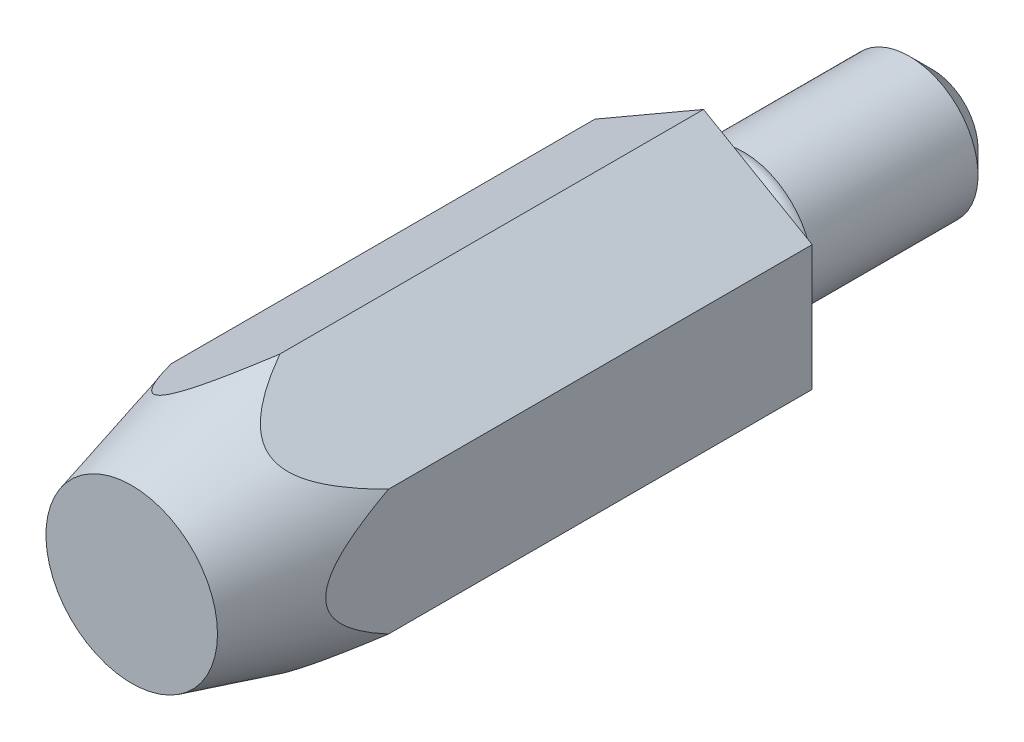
ISO-10303-21;
HEADER;
FILE_DESCRIPTION(('STEP AP214'),'2;1');
FILE_NAME('part.step','',(''),(''),'','','');
FILE_SCHEMA(('AUTOMOTIVE_DESIGN { 1 0 10303 214 1 1 1 1 }'));
ENDSEC;
DATA;
#1=APPLICATION_CONTEXT('core data for automotive mechanical design processes');
#2=APPLICATION_PROTOCOL_DEFINITION('international standard','automotive_design',2000,#1);
#3=PRODUCT_CONTEXT('',#1,'mechanical');
#4=PRODUCT('Part','Part','',(#3));
#5=PRODUCT_RELATED_PRODUCT_CATEGORY('part','',(#4));
#6=PRODUCT_DEFINITION_FORMATION('','',#4);
#7=PRODUCT_DEFINITION_CONTEXT('part definition',#1,'design');
#8=PRODUCT_DEFINITION('design','',#6,#7);
#9=PRODUCT_DEFINITION_SHAPE('','',#8);
#10=(LENGTH_UNIT() NAMED_UNIT(*) SI_UNIT(.MILLI.,.METRE.));
#11=(NAMED_UNIT(*) PLANE_ANGLE_UNIT() SI_UNIT($,.RADIAN.));
#12=(NAMED_UNIT(*) SI_UNIT($,.STERADIAN.) SOLID_ANGLE_UNIT());
#13=UNCERTAINTY_MEASURE_WITH_UNIT(LENGTH_MEASURE(1.E-05),#10,'distance_accuracy_value','');
#14=(GEOMETRIC_REPRESENTATION_CONTEXT(3) GLOBAL_UNCERTAINTY_ASSIGNED_CONTEXT((#13)) GLOBAL_UNIT_ASSIGNED_CONTEXT((#10,
#11,#12)) REPRESENTATION_CONTEXT('',''));
#15=CARTESIAN_POINT('',(0.,0.,0.));
#16=DIRECTION('',(0.,0.,1.));
#17=DIRECTION('',(1.,0.,0.));
#18=AXIS2_PLACEMENT_3D('',#15,#16,#17);
#19=CARTESIAN_POINT('',(-20.8974596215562,0.,0.));
#20=DIRECTION('',(0.,0.,-1.));
#21=DIRECTION('',(-1.,0.,0.));
#22=AXIS2_PLACEMENT_3D('',#19,#20,#21);
#23=PLANE('',#22);
#24=CARTESIAN_POINT('',(0.,0.,0.));
#25=DIRECTION('',(0.,0.,-1.));
#26=DIRECTION('',(-1.,0.,0.));
#27=AXIS2_PLACEMENT_3D('',#24,#25,#26);
#28=CIRCLE('',#27,6.);
#29=CARTESIAN_POINT('',(-6.,0.,0.));
#30=VERTEX_POINT('',#29);
#31=EDGE_CURVE('E9',#30,#30,#28,.F.);
#32=ORIENTED_EDGE('',*,*,#31,.T.);
#33=EDGE_LOOP('',(#32));
#34=FACE_BOUND('',#33,.T.);
#35=DIRECTION('',(0.,1.,0.));
#36=VECTOR('',#35,1.);
#37=CARTESIAN_POINT('',(9.5,-5.48482755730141,0.));
#38=LINE('',#37,#36);
#39=CARTESIAN_POINT('',(9.5,-5.48482755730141,0.));
#40=VERTEX_POINT('',#39);
#41=CARTESIAN_POINT('',(9.5,5.48482755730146,0.));
#42=VERTEX_POINT('',#41);
#43=EDGE_CURVE('E97',#40,#42,#38,.T.);
#44=ORIENTED_EDGE('',*,*,#43,.F.);
#45=DIRECTION('',(-0.866025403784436,-0.5,0.));
#46=VECTOR('',#45,1.);
#47=CARTESIAN_POINT('',(9.5,-5.48482755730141,0.));
#48=LINE('',#47,#46);
#49=CARTESIAN_POINT('',(0.,-10.9696551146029,0.));
#50=VERTEX_POINT('',#49);
#51=EDGE_CURVE('E90',#40,#50,#48,.T.);
#52=ORIENTED_EDGE('',*,*,#51,.T.);
#53=DIRECTION('',(0.866025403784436,-0.5,0.));
#54=VECTOR('',#53,1.);
#55=CARTESIAN_POINT('',(-9.5,-5.48482755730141,0.));
#56=LINE('',#55,#54);
#57=CARTESIAN_POINT('',(-9.5,-5.48482755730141,0.));
#58=VERTEX_POINT('',#57);
#59=EDGE_CURVE('E88',#58,#50,#56,.T.);
#60=ORIENTED_EDGE('',*,*,#59,.F.);
#61=DIRECTION('',(0.,1.,0.));
#62=VECTOR('',#61,1.);
#63=CARTESIAN_POINT('',(-9.5,-5.48482755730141,0.));
#64=LINE('',#63,#62);
#65=CARTESIAN_POINT('',(-9.5,5.48482755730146,0.));
#66=VERTEX_POINT('',#65);
#67=EDGE_CURVE('E37',#58,#66,#64,.T.);
#68=ORIENTED_EDGE('',*,*,#67,.T.);
#69=DIRECTION('',(0.86602540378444,0.5,0.));
#70=VECTOR('',#69,1.);
#71=CARTESIAN_POINT('',(-9.5,5.48482755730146,0.));
#72=LINE('',#71,#70);
#73=CARTESIAN_POINT('',(0.,10.9696551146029,0.));
#74=VERTEX_POINT('',#73);
#75=EDGE_CURVE('E77',#66,#74,#72,.T.);
#76=ORIENTED_EDGE('',*,*,#75,.T.);
#77=DIRECTION('',(-0.86602540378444,0.5,0.));
#78=VECTOR('',#77,1.);
#79=CARTESIAN_POINT('',(9.5,5.48482755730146,0.));
#80=LINE('',#79,#78);
#81=EDGE_CURVE('E83',#42,#74,#80,.T.);
#82=ORIENTED_EDGE('',*,*,#81,.F.);
#83=EDGE_LOOP('',(#44,#52,#60,#68,#76,#82));
#84=FACE_BOUND('',#83,.T.);
#85=ADVANCED_FACE('F14',(#34,#84),#23,.T.);
#86=CARTESIAN_POINT('',(9.5,-5.48482755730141,50.));
#87=DIRECTION('',(0.5,-0.866025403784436,0.));
#88=DIRECTION('',(0.866025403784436,0.5,0.));
#89=AXIS2_PLACEMENT_3D('',#86,#87,#88);
#90=PLANE('',#89);
#91=DIRECTION('',(0.,0.,-1.));
#92=VECTOR('',#91,1.);
#93=CARTESIAN_POINT('',(0.,-10.9696551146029,50.));
#94=LINE('',#93,#92);
#95=CARTESIAN_POINT('',(0.,-10.9696551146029,37.0510708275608));
#96=VERTEX_POINT('',#95);
#97=EDGE_CURVE('E29',#96,#50,#94,.T.);
#98=ORIENTED_EDGE('',*,*,#97,.T.);
#99=ORIENTED_EDGE('',*,*,#51,.F.);
#100=DIRECTION('',(0.,0.,-1.));
#101=VECTOR('',#100,1.);
#102=CARTESIAN_POINT('',(9.5,-5.48482755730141,50.));
#103=LINE('',#102,#101);
#104=CARTESIAN_POINT('',(9.5,-5.48482755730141,37.0510708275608));
#105=VERTEX_POINT('',#104);
#106=EDGE_CURVE('E102',#105,#40,#103,.T.);
#107=ORIENTED_EDGE('',*,*,#106,.F.);
#108=CARTESIAN_POINT('',(-0.000199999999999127,-10.9697705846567,37.0506398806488));
#109=CARTESIAN_POINT('',(0.063241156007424,-10.9331428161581,37.1873326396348));
#110=CARTESIAN_POINT('',(0.127415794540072,-10.8960915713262,37.3235703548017));
#111=CARTESIAN_POINT('',(0.257401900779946,-10.8210440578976,37.5950151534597));
#112=CARTESIAN_POINT('',(0.323213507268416,-10.7830477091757,37.7302221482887));
#113=CARTESIAN_POINT('',(0.52358223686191,-10.6673647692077,38.1345656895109));
#114=CARTESIAN_POINT('',(0.660846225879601,-10.5881153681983,38.4019320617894));
#115=CARTESIAN_POINT('',(0.945964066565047,-10.4235025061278,38.9334480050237));
#116=CARTESIAN_POINT('',(1.09392411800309,-10.3380777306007,39.1975219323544));
#117=CARTESIAN_POINT('',(1.40133261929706,-10.1605953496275,39.7164448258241));
#118=CARTESIAN_POINT('',(1.56077178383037,-10.0685431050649,39.9713010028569));
#119=CARTESIAN_POINT('',(1.80658859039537,-9.92662070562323,40.3365360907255));
#120=CARTESIAN_POINT('',(1.8871113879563,-9.8801308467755,40.4521723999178));
#121=CARTESIAN_POINT('',(2.05203968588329,-9.78490944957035,40.6797338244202));
#122=CARTESIAN_POINT('',(2.13644563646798,-9.73617765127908,40.7916585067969));
#123=CARTESIAN_POINT('',(2.30963852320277,-9.63618469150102,41.0107949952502));
#124=CARTESIAN_POINT('',(2.39842260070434,-9.58492518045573,41.1180097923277));
#125=CARTESIAN_POINT('',(2.58105231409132,-9.47948386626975,41.3264945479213));
#126=CARTESIAN_POINT('',(2.67489689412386,-9.42530267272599,41.4277657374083));
#127=CARTESIAN_POINT('',(2.92326823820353,-9.28190541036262,41.6780572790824));
#128=CARTESIAN_POINT('',(3.08203874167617,-9.19023921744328,41.8216040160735));
#129=CARTESIAN_POINT('',(3.41628357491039,-8.99726287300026,42.0799879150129));
#130=CARTESIAN_POINT('',(3.59170735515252,-8.89598190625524,42.1949083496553));
#131=CARTESIAN_POINT('',(3.89846693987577,-8.71887417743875,42.3503714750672));
#132=CARTESIAN_POINT('',(4.02515878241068,-8.64572860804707,42.402941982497));
#133=CARTESIAN_POINT('',(4.28429141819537,-8.49611831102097,42.4834886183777));
#134=CARTESIAN_POINT('',(4.41672433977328,-8.41965812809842,42.5114973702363));
#135=CARTESIAN_POINT('',(4.68463517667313,-8.26497973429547,42.5394927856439));
#136=CARTESIAN_POINT('',(4.82012611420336,-8.18675400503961,42.5393193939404));
#137=CARTESIAN_POINT('',(5.08881445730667,-8.03162671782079,42.5105818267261));
#138=CARTESIAN_POINT('',(5.2220104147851,-7.95472599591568,42.4820003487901));
#139=CARTESIAN_POINT('',(5.50988735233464,-7.78852016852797,42.3914485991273));
#140=CARTESIAN_POINT('',(5.66317687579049,-7.70001842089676,42.3237089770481));
#141=CARTESIAN_POINT('',(5.95849657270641,-7.52951551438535,42.1610504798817));
#142=CARTESIAN_POINT('',(6.10050010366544,-7.4475297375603,42.0660695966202));
#143=CARTESIAN_POINT('',(6.35806187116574,-7.29882638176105,41.8686641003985));
#144=CARTESIAN_POINT('',(6.4748037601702,-7.2314254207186,41.768247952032));
#145=CARTESIAN_POINT('',(6.70049227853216,-7.10112409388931,41.556241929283));
#146=CARTESIAN_POINT('',(6.80943179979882,-7.03822783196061,41.4446420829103));
#147=CARTESIAN_POINT('',(7.02120735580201,-6.91595915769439,41.2123939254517));
#148=CARTESIAN_POINT('',(7.12399508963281,-6.85661463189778,41.0916875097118));
#149=CARTESIAN_POINT('',(7.32359786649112,-6.74137391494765,40.8439982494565));
#150=CARTESIAN_POINT('',(7.4204152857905,-6.68547635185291,40.7170179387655));
#151=CARTESIAN_POINT('',(7.61460905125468,-6.57335852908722,40.4504481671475));
#152=CARTESIAN_POINT('',(7.71167453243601,-6.51731774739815,40.310558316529));
#153=CARTESIAN_POINT('',(7.90097311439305,-6.40802616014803,40.0264701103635));
#154=CARTESIAN_POINT('',(7.99320530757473,-6.35477587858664,39.8822709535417));
#155=CARTESIAN_POINT('',(8.26393146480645,-6.19847205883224,39.4442211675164));
#156=CARTESIAN_POINT('',(8.43621649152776,-6.09900325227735,39.1452552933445));
#157=CARTESIAN_POINT('',(8.76213529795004,-5.91083394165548,38.5496192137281));
#158=CARTESIAN_POINT('',(8.91622398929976,-5.82187079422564,38.2532756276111));
#159=CARTESIAN_POINT('',(9.1402790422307,-5.69251254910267,37.8047329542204));
#160=CARTESIAN_POINT('',(9.2136697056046,-5.65014042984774,37.654796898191));
#161=CARTESIAN_POINT('',(9.35840758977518,-5.56657597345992,37.3536392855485));
#162=CARTESIAN_POINT('',(9.42975506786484,-5.52538348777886,37.2024178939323));
#163=CARTESIAN_POINT('',(9.50020000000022,-5.48471208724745,37.0506398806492));
#164=B_SPLINE_CURVE_WITH_KNOTS('',3,(#108,#109,#110,#111,#112,#113,#114,#115,#116,#117,#118,
#119,#120,#121,#122,#123,#124,#125,#126,#127,#128,#129,#130,#131,#132,#133,#134,#135,#136,#137,
#138,#139,#140,#141,#142,#143,#144,#145,#146,#147,#148,#149,#150,#151,#152,#153,#154,#155,#156,
#157,#158,#159,#160,#161,#162,#163),.UNSPECIFIED.,.F.,.F.,(4,2,2,2,2,2,2,2,2,2,2,2,2,2,2,2,2,2,
2,2,2,2,2,2,2,2,2,4),(0.,0.46524752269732,0.930534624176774,1.8627826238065,2.80607583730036,
3.74861442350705,4.19366832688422,4.63877396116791,5.08359272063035,5.52831902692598,
6.2251376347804,6.9199049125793,7.38453577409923,7.84854856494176,8.31519672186,
8.78212927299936,9.34751434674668,9.91419673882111,10.4177403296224,10.9217369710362,
11.4292773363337,11.9366143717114,12.4742009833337,13.0118881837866,14.0885655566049,
15.1252825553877,15.6419477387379,16.1585475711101),.UNSPECIFIED.);
#165=EDGE_CURVE('E157',#96,#105,#164,.T.);
#166=ORIENTED_EDGE('',*,*,#165,.F.);
#167=EDGE_LOOP('',(#98,#99,#107,#166));
#168=FACE_BOUND('',#167,.T.);
#169=ADVANCED_FACE('F127',(#168),#90,.T.);
#170=CARTESIAN_POINT('',(9.5,-5.48482755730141,50.));
#171=DIRECTION('',(-1.,0.,0.));
#172=DIRECTION('',(0.,0.,1.));
#173=AXIS2_PLACEMENT_3D('',#170,#171,#172);
#174=PLANE('',#173);
#175=CARTESIAN_POINT('',(9.5,-5.50690282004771,37.0098157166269));
#176=CARTESIAN_POINT('',(9.5,-5.43449794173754,37.1453244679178));
#177=CARTESIAN_POINT('',(9.5,-5.36126926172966,37.2803919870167));
#178=CARTESIAN_POINT('',(9.5,-5.21297685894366,37.5495292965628));
#179=CARTESIAN_POINT('',(9.5,-5.13791299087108,37.6835990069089));
#180=CARTESIAN_POINT('',(9.5,-4.90945209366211,38.084549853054));
#181=CARTESIAN_POINT('',(9.5,-4.75302513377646,38.3497216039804));
#182=CARTESIAN_POINT('',(9.5,-4.42816442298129,38.8773190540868));
#183=CARTESIAN_POINT('',(9.5,-4.25960272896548,39.139666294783));
#184=CARTESIAN_POINT('',(9.5,-3.90967873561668,39.655539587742));
#185=CARTESIAN_POINT('',(9.5,-3.72832595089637,39.9090719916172));
#186=CARTESIAN_POINT('',(9.5,-3.44418451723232,40.2791865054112));
#187=CARTESIAN_POINT('',(9.5,-3.34768399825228,40.400597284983));
#188=CARTESIAN_POINT('',(9.5,-3.14987299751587,40.639483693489));
#189=CARTESIAN_POINT('',(9.5,-3.04856186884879,40.7569587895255));
#190=CARTESIAN_POINT('',(9.5,-2.84053345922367,40.9868074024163));
#191=CARTESIAN_POINT('',(9.5,-2.73382264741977,41.0991867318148));
#192=CARTESIAN_POINT('',(9.5,-2.51406548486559,41.3175306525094));
#193=CARTESIAN_POINT('',(9.5,-2.40102082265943,41.4234969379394));
#194=CARTESIAN_POINT('',(9.5,-2.11274503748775,41.6750665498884));
#195=CARTESIAN_POINT('',(9.5,-1.93325115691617,41.8159004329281));
#196=CARTESIAN_POINT('',(9.5,-1.55576465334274,42.0702530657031));
#197=CARTESIAN_POINT('',(9.5,-1.35782130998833,42.1838418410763));
#198=CARTESIAN_POINT('',(9.5,-1.00812100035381,42.3407212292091));
#199=CARTESIAN_POINT('',(9.5,-0.861322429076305,42.3948867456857));
#200=CARTESIAN_POINT('',(9.5,-0.560833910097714,42.4785511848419));
#201=CARTESIAN_POINT('',(9.5,-0.407153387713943,42.5080828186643));
#202=CARTESIAN_POINT('',(9.5,-0.0959284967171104,42.5388617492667));
#203=CARTESIAN_POINT('',(9.5,0.0616337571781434,42.539934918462));
#204=CARTESIAN_POINT('',(9.5,0.37425884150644,42.5132038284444));
#205=CARTESIAN_POINT('',(9.5,0.52932038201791,42.4853851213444));
#206=CARTESIAN_POINT('',(9.5,0.862120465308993,42.3966038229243));
#207=CARTESIAN_POINT('',(9.5,1.03838297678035,42.330234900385));
#208=CARTESIAN_POINT('',(9.5,1.37809462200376,42.1703677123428));
#209=CARTESIAN_POINT('',(9.5,1.54151464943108,42.076809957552));
#210=CARTESIAN_POINT('',(9.5,1.83708049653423,41.8826646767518));
#211=CARTESIAN_POINT('',(9.5,1.97064695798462,41.7841860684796));
#212=CARTESIAN_POINT('',(9.5,2.22894000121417,41.5761481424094));
#213=CARTESIAN_POINT('',(9.5,2.35365871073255,41.4665791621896));
#214=CARTESIAN_POINT('',(9.5,2.59636973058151,41.2382587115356));
#215=CARTESIAN_POINT('',(9.5,2.71429366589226,41.1194353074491));
#216=CARTESIAN_POINT('',(9.5,2.94328893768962,40.8755264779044));
#217=CARTESIAN_POINT('',(9.5,3.05436376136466,40.7504442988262));
#218=CARTESIAN_POINT('',(9.5,3.36003248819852,40.3901674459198));
#219=CARTESIAN_POINT('',(9.5,3.54790883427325,40.149283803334));
#220=CARTESIAN_POINT('',(9.5,3.90910308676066,39.6567624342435));
#221=CARTESIAN_POINT('',(9.5,4.08241002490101,39.4051168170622));
#222=CARTESIAN_POINT('',(9.5,4.4181487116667,38.8934314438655));
#223=CARTESIAN_POINT('',(9.5,4.58053946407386,38.6333649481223));
#224=CARTESIAN_POINT('',(9.5,4.89611131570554,38.1076958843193));
#225=CARTESIAN_POINT('',(9.5,5.04929122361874,37.8420926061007));
#226=CARTESIAN_POINT('',(9.5,5.33707356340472,37.3264992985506));
#227=CARTESIAN_POINT('',(9.5,5.47221212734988,37.0768071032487));
#228=CARTESIAN_POINT('',(9.5,5.73707028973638,36.5745409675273));
#229=CARTESIAN_POINT('',(9.5,5.86678934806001,36.321966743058));
#230=CARTESIAN_POINT('',(9.5,6.12050747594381,35.816690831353));
#231=CARTESIAN_POINT('',(9.5,6.24454619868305,35.5640089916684));
#232=CARTESIAN_POINT('',(9.5,6.48865135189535,35.0568027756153));
#233=CARTESIAN_POINT('',(9.5,6.60871868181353,34.8022788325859));
#234=CARTESIAN_POINT('',(9.5,6.72711372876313,34.5469917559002));
#235=B_SPLINE_CURVE_WITH_KNOTS('',3,(#175,#176,#177,#178,#179,#180,#181,#182,#183,#184,#185,
#186,#187,#188,#189,#190,#191,#192,#193,#194,#195,#196,#197,#198,#199,#200,#201,#202,#203,#204,
#205,#206,#207,#208,#209,#210,#211,#212,#213,#214,#215,#216,#217,#218,#219,#220,#221,#222,#223,
#224,#225,#226,#227,#228,#229,#230,#231,#232,#233,#234),.UNSPECIFIED.,.F.,.F.,(4,2,2,2,2,2,2,2,
2,2,2,2,2,2,2,2,2,2,2,2,2,2,2,2,2,2,2,2,2,4),(0.,0.460912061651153,0.921860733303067,
1.84528955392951,2.78052501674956,3.71507199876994,4.18024448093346,4.64547969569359,
5.11017015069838,5.57473730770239,6.25758051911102,6.93864940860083,7.40634742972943,
7.87342340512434,8.34335660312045,8.81352491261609,9.37539882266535,9.93851149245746,
10.4356286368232,10.9331826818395,11.4350886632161,11.9367369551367,12.8523481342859,
13.7686425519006,14.6882053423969,15.6078868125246,16.4595595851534,17.3113170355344,
18.1557358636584,18.9999621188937),.UNSPECIFIED.);
#236=CARTESIAN_POINT('',(9.5,5.48482755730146,37.0510708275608));
#237=VERTEX_POINT('',#236);
#238=EDGE_CURVE('E151',#237,#105,#235,.F.);
#239=ORIENTED_EDGE('',*,*,#238,.T.);
#240=ORIENTED_EDGE('',*,*,#106,.T.);
#241=ORIENTED_EDGE('',*,*,#43,.T.);
#242=DIRECTION('',(0.,0.,-1.));
#243=VECTOR('',#242,1.);
#244=CARTESIAN_POINT('',(9.5,5.48482755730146,50.));
#245=LINE('',#244,#243);
#246=EDGE_CURVE('E100',#237,#42,#245,.T.);
#247=ORIENTED_EDGE('',*,*,#246,.F.);
#248=EDGE_LOOP('',(#239,#240,#241,#247));
#249=FACE_BOUND('',#248,.T.);
#250=ADVANCED_FACE('F163',(#249),#174,.F.);
#251=CARTESIAN_POINT('',(9.5,5.48482755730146,50.));
#252=DIRECTION('',(-0.5,-0.86602540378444,0.));
#253=DIRECTION('',(0.86602540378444,-0.5,0.));
#254=AXIS2_PLACEMENT_3D('',#251,#252,#253);
#255=PLANE('',#254);
#256=CARTESIAN_POINT('',(-0.000200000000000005,10.9697705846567,37.050639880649));
#257=CARTESIAN_POINT('',(0.0632411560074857,10.9331428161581,37.1873326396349));
#258=CARTESIAN_POINT('',(0.127415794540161,10.8960915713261,37.3235703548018));
#259=CARTESIAN_POINT('',(0.257401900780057,10.8210440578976,37.5950151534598));
#260=CARTESIAN_POINT('',(0.323213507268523,10.7830477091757,37.7302221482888));
#261=CARTESIAN_POINT('',(0.523582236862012,10.6673647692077,38.134565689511));
#262=CARTESIAN_POINT('',(0.66084622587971,10.5881153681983,38.4019320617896));
#263=CARTESIAN_POINT('',(0.945964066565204,10.4235025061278,38.9334480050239));
#264=CARTESIAN_POINT('',(1.09392411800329,10.3380777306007,39.1975219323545));
#265=CARTESIAN_POINT('',(1.4013326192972,10.1605953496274,39.7164448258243));
#266=CARTESIAN_POINT('',(1.5607717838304,10.0685431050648,39.9713010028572));
#267=CARTESIAN_POINT('',(1.80658859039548,9.92662070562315,40.3365360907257));
#268=CARTESIAN_POINT('',(1.88711138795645,9.88013084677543,40.4521723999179));
#269=CARTESIAN_POINT('',(2.05203968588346,9.78490944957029,40.6797338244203));
#270=CARTESIAN_POINT('',(2.13644563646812,9.73617765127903,40.791658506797));
#271=CARTESIAN_POINT('',(2.30963852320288,9.63618469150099,41.0107949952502));
#272=CARTESIAN_POINT('',(2.39842260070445,9.58492518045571,41.1180097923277));
#273=CARTESIAN_POINT('',(2.58105231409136,9.47948386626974,41.3264945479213));
#274=CARTESIAN_POINT('',(2.67489689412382,9.425302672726,41.4277657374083));
#275=CARTESIAN_POINT('',(2.92326823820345,9.28190541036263,41.6780572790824));
#276=CARTESIAN_POINT('',(3.08203874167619,9.19023921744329,41.8216040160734));
#277=CARTESIAN_POINT('',(3.41628357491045,8.99726287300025,42.0799879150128));
#278=CARTESIAN_POINT('',(3.59170735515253,8.89598190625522,42.1949083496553));
#279=CARTESIAN_POINT('',(3.8984669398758,8.71887417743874,42.3503714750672));
#280=CARTESIAN_POINT('',(4.02515878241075,8.64572860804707,42.4029419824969));
#281=CARTESIAN_POINT('',(4.28429141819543,8.49611831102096,42.4834886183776));
#282=CARTESIAN_POINT('',(4.41672433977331,8.4196581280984,42.5114973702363));
#283=CARTESIAN_POINT('',(4.68463517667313,8.26497973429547,42.5394927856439));
#284=CARTESIAN_POINT('',(4.82012611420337,8.18675400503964,42.5393193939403));
#285=CARTESIAN_POINT('',(5.08881445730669,8.03162671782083,42.510581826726));
#286=CARTESIAN_POINT('',(5.22201041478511,7.95472599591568,42.4820003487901));
#287=CARTESIAN_POINT('',(5.50988735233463,7.78852016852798,42.3914485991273));
#288=CARTESIAN_POINT('',(5.66317687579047,7.70001842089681,42.323708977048));
#289=CARTESIAN_POINT('',(5.9584965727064,7.5295155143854,42.1610504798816));
#290=CARTESIAN_POINT('',(6.10050010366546,7.44752973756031,42.0660695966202));
#291=CARTESIAN_POINT('',(6.35806187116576,7.29882638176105,41.8686641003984));
#292=CARTESIAN_POINT('',(6.4748037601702,7.23142542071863,41.7682479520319));
#293=CARTESIAN_POINT('',(6.70049227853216,7.10112409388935,41.5562419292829));
#294=CARTESIAN_POINT('',(6.80943179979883,7.03822783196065,41.4446420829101));
#295=CARTESIAN_POINT('',(7.02120735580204,6.91595915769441,41.2123939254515));
#296=CARTESIAN_POINT('',(7.12399508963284,6.85661463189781,41.0916875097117));
#297=CARTESIAN_POINT('',(7.32359786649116,6.74137391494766,40.8439982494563));
#298=CARTESIAN_POINT('',(7.42041528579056,6.6854763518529,40.7170179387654));
#299=CARTESIAN_POINT('',(7.61460905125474,6.57335852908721,40.4504481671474));
#300=CARTESIAN_POINT('',(7.71167453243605,6.51731774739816,40.3105583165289));
#301=CARTESIAN_POINT('',(7.90097311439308,6.40802616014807,40.0264701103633));
#302=CARTESIAN_POINT('',(7.99320530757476,6.35477587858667,39.8822709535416));
#303=CARTESIAN_POINT('',(8.26393146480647,6.19847205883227,39.4442211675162));
#304=CARTESIAN_POINT('',(8.43621649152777,6.09900325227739,39.1452552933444));
#305=CARTESIAN_POINT('',(8.76213529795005,5.91083394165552,38.549619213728));
#306=CARTESIAN_POINT('',(8.91622398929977,5.82187079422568,38.253275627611));
#307=CARTESIAN_POINT('',(9.14027904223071,5.69251254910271,37.8047329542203));
#308=CARTESIAN_POINT('',(9.21366970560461,5.65014042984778,37.6547968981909));
#309=CARTESIAN_POINT('',(9.35840758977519,5.56657597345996,37.3536392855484));
#310=CARTESIAN_POINT('',(9.42975506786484,5.5253834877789,37.2024178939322));
#311=CARTESIAN_POINT('',(9.50020000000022,5.48471208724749,37.0506398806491));
#312=B_SPLINE_CURVE_WITH_KNOTS('',3,(#256,#257,#258,#259,#260,#261,#262,#263,#264,#265,#266,
#267,#268,#269,#270,#271,#272,#273,#274,#275,#276,#277,#278,#279,#280,#281,#282,#283,#284,#285,
#286,#287,#288,#289,#290,#291,#292,#293,#294,#295,#296,#297,#298,#299,#300,#301,#302,#303,#304,
#305,#306,#307,#308,#309,#310,#311),.UNSPECIFIED.,.F.,.F.,(4,2,2,2,2,2,2,2,2,2,2,2,2,2,2,2,2,2,
2,2,2,2,2,2,2,2,2,4),(0.,0.465247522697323,0.930534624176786,1.86278262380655,2.80607583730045,
3.74861442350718,4.19366832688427,4.63877396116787,5.08359272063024,5.52831902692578,
6.22513763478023,6.91990491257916,7.38453577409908,7.8485485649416,8.31519672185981,
8.78212927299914,9.34751434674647,9.91419673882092,10.4177403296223,10.921736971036,
11.4292773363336,11.9366143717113,12.4742009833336,13.0118881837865,14.0885655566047,
15.1252825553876,15.6419477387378,16.1585475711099),.UNSPECIFIED.);
#313=CARTESIAN_POINT('',(0.,10.9696551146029,37.0510708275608));
#314=VERTEX_POINT('',#313);
#315=EDGE_CURVE('E145',#314,#237,#312,.T.);
#316=ORIENTED_EDGE('',*,*,#315,.T.);
#317=ORIENTED_EDGE('',*,*,#246,.T.);
#318=ORIENTED_EDGE('',*,*,#81,.T.);
#319=DIRECTION('',(0.,0.,-1.));
#320=VECTOR('',#319,1.);
#321=CARTESIAN_POINT('',(0.,10.9696551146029,50.));
#322=LINE('',#321,#320);
#323=EDGE_CURVE('E73',#314,#74,#322,.T.);
#324=ORIENTED_EDGE('',*,*,#323,.F.);
#325=EDGE_LOOP('',(#316,#317,#318,#324));
#326=FACE_BOUND('',#325,.T.);
#327=ADVANCED_FACE('F136',(#326),#255,.F.);
#328=CARTESIAN_POINT('',(-9.5,5.48482755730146,50.));
#329=DIRECTION('',(-0.5,0.86602540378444,0.));
#330=DIRECTION('',(-0.86602540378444,-0.5,0.));
#331=AXIS2_PLACEMENT_3D('',#328,#329,#330);
#332=PLANE('',#331);
#333=ORIENTED_EDGE('',*,*,#323,.T.);
#334=ORIENTED_EDGE('',*,*,#75,.F.);
#335=DIRECTION('',(0.,0.,-1.));
#336=VECTOR('',#335,1.);
#337=CARTESIAN_POINT('',(-9.5,5.48482755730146,50.));
#338=LINE('',#337,#336);
#339=CARTESIAN_POINT('',(-9.5,5.48482755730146,37.0510708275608));
#340=VERTEX_POINT('',#339);
#341=EDGE_CURVE('E66',#340,#66,#338,.T.);
#342=ORIENTED_EDGE('',*,*,#341,.F.);
#343=CARTESIAN_POINT('',(0.000199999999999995,10.9697705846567,37.050639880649));
#344=CARTESIAN_POINT('',(-0.0632411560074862,10.9331428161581,37.1873326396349));
#345=CARTESIAN_POINT('',(-0.127415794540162,10.8960915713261,37.3235703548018));
#346=CARTESIAN_POINT('',(-0.257401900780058,10.8210440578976,37.5950151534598));
#347=CARTESIAN_POINT('',(-0.323213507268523,10.7830477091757,37.7302221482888));
#348=CARTESIAN_POINT('',(-0.523582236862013,10.6673647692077,38.134565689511));
#349=CARTESIAN_POINT('',(-0.660846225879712,10.5881153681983,38.4019320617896));
#350=CARTESIAN_POINT('',(-0.945964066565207,10.4235025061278,38.9334480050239));
#351=CARTESIAN_POINT('',(-1.09392411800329,10.3380777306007,39.1975219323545));
#352=CARTESIAN_POINT('',(-1.4013326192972,10.1605953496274,39.7164448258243));
#353=CARTESIAN_POINT('',(-1.5607717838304,10.0685431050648,39.9713010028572));
#354=CARTESIAN_POINT('',(-1.80658859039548,9.92662070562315,40.3365360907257));
#355=CARTESIAN_POINT('',(-1.88711138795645,9.88013084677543,40.4521723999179));
#356=CARTESIAN_POINT('',(-2.05203968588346,9.78490944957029,40.6797338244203));
#357=CARTESIAN_POINT('',(-2.13644563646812,9.73617765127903,40.791658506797));
#358=CARTESIAN_POINT('',(-2.30963852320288,9.63618469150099,41.0107949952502));
#359=CARTESIAN_POINT('',(-2.39842260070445,9.5849251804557,41.1180097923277));
#360=CARTESIAN_POINT('',(-2.58105231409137,9.47948386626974,41.3264945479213));
#361=CARTESIAN_POINT('',(-2.67489689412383,9.425302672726,41.4277657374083));
#362=CARTESIAN_POINT('',(-2.92326823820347,9.28190541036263,41.6780572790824));
#363=CARTESIAN_POINT('',(-3.0820387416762,9.19023921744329,41.8216040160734));
#364=CARTESIAN_POINT('',(-3.41628357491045,8.99726287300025,42.0799879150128));
#365=CARTESIAN_POINT('',(-3.59170735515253,8.89598190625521,42.1949083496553));
#366=CARTESIAN_POINT('',(-3.8984669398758,8.71887417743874,42.3503714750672));
#367=CARTESIAN_POINT('',(-4.02515878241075,8.64572860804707,42.4029419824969));
#368=CARTESIAN_POINT('',(-4.28429141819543,8.49611831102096,42.4834886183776));
#369=CARTESIAN_POINT('',(-4.41672433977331,8.41965812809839,42.5114973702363));
#370=CARTESIAN_POINT('',(-4.68463517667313,8.26497973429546,42.5394927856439));
#371=CARTESIAN_POINT('',(-4.82012611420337,8.18675400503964,42.5393193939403));
#372=CARTESIAN_POINT('',(-5.08881445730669,8.03162671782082,42.510581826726));
#373=CARTESIAN_POINT('',(-5.22201041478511,7.95472599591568,42.4820003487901));
#374=CARTESIAN_POINT('',(-5.50988735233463,7.78852016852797,42.3914485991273));
#375=CARTESIAN_POINT('',(-5.66317687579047,7.70001842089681,42.323708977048));
#376=CARTESIAN_POINT('',(-5.9584965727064,7.5295155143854,42.1610504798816));
#377=CARTESIAN_POINT('',(-6.10050010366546,7.4475297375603,42.0660695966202));
#378=CARTESIAN_POINT('',(-6.35806187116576,7.29882638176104,41.8686641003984));
#379=CARTESIAN_POINT('',(-6.47480376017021,7.23142542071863,41.7682479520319));
#380=CARTESIAN_POINT('',(-6.70049227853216,7.10112409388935,41.5562419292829));
#381=CARTESIAN_POINT('',(-6.80943179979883,7.03822783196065,41.4446420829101));
#382=CARTESIAN_POINT('',(-7.02120735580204,6.91595915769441,41.2123939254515));
#383=CARTESIAN_POINT('',(-7.12399508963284,6.85661463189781,41.0916875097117));
#384=CARTESIAN_POINT('',(-7.32359786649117,6.74137391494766,40.8439982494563));
#385=CARTESIAN_POINT('',(-7.42041528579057,6.6854763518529,40.7170179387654));
#386=CARTESIAN_POINT('',(-7.61460905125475,6.57335852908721,40.4504481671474));
#387=CARTESIAN_POINT('',(-7.71167453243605,6.51731774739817,40.3105583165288));
#388=CARTESIAN_POINT('',(-7.90097311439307,6.40802616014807,40.0264701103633));
#389=CARTESIAN_POINT('',(-7.99320530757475,6.35477587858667,39.8822709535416));
#390=CARTESIAN_POINT('',(-8.26393146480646,6.19847205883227,39.4442211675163));
#391=CARTESIAN_POINT('',(-8.43621649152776,6.09900325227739,39.1452552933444));
#392=CARTESIAN_POINT('',(-8.76213529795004,5.91083394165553,38.549619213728));
#393=CARTESIAN_POINT('',(-8.91622398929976,5.82187079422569,38.2532756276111));
#394=CARTESIAN_POINT('',(-9.14027904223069,5.69251254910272,37.8047329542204));
#395=CARTESIAN_POINT('',(-9.21366970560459,5.65014042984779,37.6547968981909));
#396=CARTESIAN_POINT('',(-9.35840758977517,5.56657597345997,37.3536392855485));
#397=CARTESIAN_POINT('',(-9.42975506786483,5.52538348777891,37.2024178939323));
#398=CARTESIAN_POINT('',(-9.50020000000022,5.4847120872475,37.0506398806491));
#399=B_SPLINE_CURVE_WITH_KNOTS('',3,(#343,#344,#345,#346,#347,#348,#349,#350,#351,#352,#353,
#354,#355,#356,#357,#358,#359,#360,#361,#362,#363,#364,#365,#366,#367,#368,#369,#370,#371,#372,
#373,#374,#375,#376,#377,#378,#379,#380,#381,#382,#383,#384,#385,#386,#387,#388,#389,#390,#391,
#392,#393,#394,#395,#396,#397,#398),.UNSPECIFIED.,.F.,.F.,(4,2,2,2,2,2,2,2,2,2,2,2,2,2,2,2,2,2,
2,2,2,2,2,2,2,2,2,4),(0.,0.465247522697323,0.930534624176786,1.86278262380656,2.80607583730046,
3.74861442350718,4.19366832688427,4.63877396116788,5.08359272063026,5.52831902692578,
6.22513763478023,6.91990491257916,7.38453577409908,7.8485485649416,8.31519672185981,
8.78212927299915,9.34751434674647,9.91419673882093,10.4177403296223,10.921736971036,
11.4292773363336,11.9366143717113,12.4742009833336,13.0118881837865,14.0885655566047,
15.1252825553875,15.6419477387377,16.1585475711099),.UNSPECIFIED.);
#400=EDGE_CURVE('E139',#314,#340,#399,.T.);
#401=ORIENTED_EDGE('',*,*,#400,.F.);
#402=EDGE_LOOP('',(#333,#334,#342,#401));
#403=FACE_BOUND('',#402,.T.);
#404=ADVANCED_FACE('F78',(#403),#332,.T.);
#405=CARTESIAN_POINT('',(-9.5,-5.48482755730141,50.));
#406=DIRECTION('',(-1.,0.,0.));
#407=DIRECTION('',(0.,0.,1.));
#408=AXIS2_PLACEMENT_3D('',#405,#406,#407);
#409=PLANE('',#408);
#410=ORIENTED_EDGE('',*,*,#341,.T.);
#411=ORIENTED_EDGE('',*,*,#67,.F.);
#412=DIRECTION('',(0.,0.,-1.));
#413=VECTOR('',#412,1.);
#414=CARTESIAN_POINT('',(-9.5,-5.48482755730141,50.));
#415=LINE('',#414,#413);
#416=CARTESIAN_POINT('',(-9.5,-5.48482755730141,37.0510708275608));
#417=VERTEX_POINT('',#416);
#418=EDGE_CURVE('E74',#417,#58,#415,.T.);
#419=ORIENTED_EDGE('',*,*,#418,.F.);
#420=CARTESIAN_POINT('',(-9.5,-5.50690282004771,37.0098157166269));
#421=CARTESIAN_POINT('',(-9.5,-5.43449794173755,37.1453244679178));
#422=CARTESIAN_POINT('',(-9.5,-5.36126926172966,37.2803919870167));
#423=CARTESIAN_POINT('',(-9.5,-5.21297685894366,37.5495292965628));
#424=CARTESIAN_POINT('',(-9.5,-5.13791299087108,37.6835990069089));
#425=CARTESIAN_POINT('',(-9.5,-4.90945209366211,38.084549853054));
#426=CARTESIAN_POINT('',(-9.5,-4.75302513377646,38.3497216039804));
#427=CARTESIAN_POINT('',(-9.5,-4.42816442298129,38.8773190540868));
#428=CARTESIAN_POINT('',(-9.5,-4.25960272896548,39.139666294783));
#429=CARTESIAN_POINT('',(-9.5,-3.90967873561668,39.655539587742));
#430=CARTESIAN_POINT('',(-9.5,-3.72832595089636,39.9090719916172));
#431=CARTESIAN_POINT('',(-9.5,-3.44418451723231,40.2791865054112));
#432=CARTESIAN_POINT('',(-9.5,-3.34768399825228,40.400597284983));
#433=CARTESIAN_POINT('',(-9.5,-3.14987299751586,40.639483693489));
#434=CARTESIAN_POINT('',(-9.5,-3.04856186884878,40.7569587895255));
#435=CARTESIAN_POINT('',(-9.5,-2.84053345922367,40.9868074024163));
#436=CARTESIAN_POINT('',(-9.5,-2.73382264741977,41.0991867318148));
#437=CARTESIAN_POINT('',(-9.5,-2.51406548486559,41.3175306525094));
#438=CARTESIAN_POINT('',(-9.5,-2.40102082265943,41.4234969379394));
#439=CARTESIAN_POINT('',(-9.5,-2.11274503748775,41.6750665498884));
#440=CARTESIAN_POINT('',(-9.5,-1.93325115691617,41.8159004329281));
#441=CARTESIAN_POINT('',(-9.5,-1.55576465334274,42.0702530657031));
#442=CARTESIAN_POINT('',(-9.5,-1.35782130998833,42.1838418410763));
#443=CARTESIAN_POINT('',(-9.5,-1.00812100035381,42.3407212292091));
#444=CARTESIAN_POINT('',(-9.5,-0.861322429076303,42.3948867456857));
#445=CARTESIAN_POINT('',(-9.5,-0.560833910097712,42.4785511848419));
#446=CARTESIAN_POINT('',(-9.5,-0.407153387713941,42.5080828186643));
#447=CARTESIAN_POINT('',(-9.5,-0.0959284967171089,42.5388617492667));
#448=CARTESIAN_POINT('',(-9.5,0.0616337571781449,42.539934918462));
#449=CARTESIAN_POINT('',(-9.5,0.374258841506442,42.5132038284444));
#450=CARTESIAN_POINT('',(-9.5,0.529320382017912,42.4853851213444));
#451=CARTESIAN_POINT('',(-9.5,0.862120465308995,42.3966038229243));
#452=CARTESIAN_POINT('',(-9.5,1.03838297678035,42.330234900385));
#453=CARTESIAN_POINT('',(-9.5,1.37809462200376,42.1703677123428));
#454=CARTESIAN_POINT('',(-9.5,1.54151464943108,42.076809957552));
#455=CARTESIAN_POINT('',(-9.5,1.83708049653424,41.8826646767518));
#456=CARTESIAN_POINT('',(-9.5,1.97064695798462,41.7841860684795));
#457=CARTESIAN_POINT('',(-9.5,2.22894000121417,41.5761481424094));
#458=CARTESIAN_POINT('',(-9.5,2.35365871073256,41.4665791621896));
#459=CARTESIAN_POINT('',(-9.5,2.59636973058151,41.2382587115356));
#460=CARTESIAN_POINT('',(-9.5,2.71429366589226,41.1194353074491));
#461=CARTESIAN_POINT('',(-9.5,2.94328893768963,40.8755264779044));
#462=CARTESIAN_POINT('',(-9.5,3.05436376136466,40.7504442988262));
#463=CARTESIAN_POINT('',(-9.5,3.36003248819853,40.3901674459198));
#464=CARTESIAN_POINT('',(-9.5,3.54790883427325,40.149283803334));
#465=CARTESIAN_POINT('',(-9.5,3.90910308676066,39.6567624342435));
#466=CARTESIAN_POINT('',(-9.5,4.08241002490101,39.4051168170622));
#467=CARTESIAN_POINT('',(-9.5,4.41814871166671,38.8934314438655));
#468=CARTESIAN_POINT('',(-9.5,4.58053946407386,38.6333649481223));
#469=CARTESIAN_POINT('',(-9.5,4.89611131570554,38.1076958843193));
#470=CARTESIAN_POINT('',(-9.5,5.04929122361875,37.8420926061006));
#471=CARTESIAN_POINT('',(-9.5,5.33707356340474,37.3264992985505));
#472=CARTESIAN_POINT('',(-9.5,5.47221212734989,37.0768071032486));
#473=CARTESIAN_POINT('',(-9.5,5.7370702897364,36.5745409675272));
#474=CARTESIAN_POINT('',(-9.5,5.86678934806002,36.3219667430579));
#475=CARTESIAN_POINT('',(-9.5,6.12050747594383,35.8166908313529));
#476=CARTESIAN_POINT('',(-9.5,6.24454619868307,35.5640089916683));
#477=CARTESIAN_POINT('',(-9.5,6.48865135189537,35.0568027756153));
#478=CARTESIAN_POINT('',(-9.5,6.60871868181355,34.8022788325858));
#479=CARTESIAN_POINT('',(-9.5,6.72711372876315,34.5469917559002));
#480=B_SPLINE_CURVE_WITH_KNOTS('',3,(#420,#421,#422,#423,#424,#425,#426,#427,#428,#429,#430,
#431,#432,#433,#434,#435,#436,#437,#438,#439,#440,#441,#442,#443,#444,#445,#446,#447,#448,#449,
#450,#451,#452,#453,#454,#455,#456,#457,#458,#459,#460,#461,#462,#463,#464,#465,#466,#467,#468,
#469,#470,#471,#472,#473,#474,#475,#476,#477,#478,#479),.UNSPECIFIED.,.F.,.F.,(4,2,2,2,2,2,2,2,
2,2,2,2,2,2,2,2,2,2,2,2,2,2,2,2,2,2,2,2,2,4),(0.,0.460912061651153,0.921860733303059,
1.84528955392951,2.78052501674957,3.71507199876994,4.18024448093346,4.64547969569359,
5.11017015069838,5.57473730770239,6.25758051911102,6.93864940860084,7.40634742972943,
7.87342340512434,8.34335660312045,8.8135249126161,9.37539882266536,9.93851149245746,
10.4356286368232,10.9331826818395,11.4350886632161,11.9367369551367,12.8523481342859,
13.7686425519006,14.6882053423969,15.6078868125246,16.4595595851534,17.3113170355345,
18.1557358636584,18.9999621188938),.UNSPECIFIED.);
#481=EDGE_CURVE('E70',#340,#417,#480,.F.);
#482=ORIENTED_EDGE('',*,*,#481,.F.);
#483=EDGE_LOOP('',(#410,#411,#419,#482));
#484=FACE_BOUND('',#483,.T.);
#485=ADVANCED_FACE('F68',(#484),#409,.T.);
#486=CARTESIAN_POINT('',(-9.5,-5.48482755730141,50.));
#487=DIRECTION('',(0.5,0.866025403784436,0.));
#488=DIRECTION('',(-0.866025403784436,0.5,0.));
#489=AXIS2_PLACEMENT_3D('',#486,#487,#488);
#490=PLANE('',#489);
#491=CARTESIAN_POINT('',(0.000200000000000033,-10.9697705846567,37.0506398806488));
#492=CARTESIAN_POINT('',(-0.0632411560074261,-10.9331428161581,37.1873326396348));
#493=CARTESIAN_POINT('',(-0.127415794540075,-10.8960915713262,37.3235703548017));
#494=CARTESIAN_POINT('',(-0.257401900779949,-10.8210440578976,37.5950151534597));
#495=CARTESIAN_POINT('',(-0.323213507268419,-10.7830477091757,37.7302221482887));
#496=CARTESIAN_POINT('',(-0.523582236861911,-10.6673647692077,38.1345656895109));
#497=CARTESIAN_POINT('',(-0.660846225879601,-10.5881153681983,38.4019320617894));
#498=CARTESIAN_POINT('',(-0.945964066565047,-10.4235025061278,38.9334480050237));
#499=CARTESIAN_POINT('',(-1.09392411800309,-10.3380777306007,39.1975219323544));
#500=CARTESIAN_POINT('',(-1.40133261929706,-10.1605953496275,39.7164448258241));
#501=CARTESIAN_POINT('',(-1.56077178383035,-10.0685431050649,39.9713010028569));
#502=CARTESIAN_POINT('',(-1.80658859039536,-9.92662070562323,40.3365360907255));
#503=CARTESIAN_POINT('',(-1.88711138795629,-9.8801308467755,40.4521723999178));
#504=CARTESIAN_POINT('',(-2.05203968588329,-9.78490944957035,40.6797338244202));
#505=CARTESIAN_POINT('',(-2.13644563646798,-9.73617765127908,40.7916585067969));
#506=CARTESIAN_POINT('',(-2.30963852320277,-9.63618469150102,41.0107949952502));
#507=CARTESIAN_POINT('',(-2.39842260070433,-9.58492518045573,41.1180097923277));
#508=CARTESIAN_POINT('',(-2.58105231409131,-9.47948386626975,41.3264945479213));
#509=CARTESIAN_POINT('',(-2.67489689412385,-9.42530267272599,41.4277657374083));
#510=CARTESIAN_POINT('',(-2.92326823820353,-9.28190541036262,41.6780572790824));
#511=CARTESIAN_POINT('',(-3.08203874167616,-9.19023921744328,41.8216040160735));
#512=CARTESIAN_POINT('',(-3.41628357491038,-8.99726287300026,42.0799879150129));
#513=CARTESIAN_POINT('',(-3.59170735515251,-8.89598190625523,42.1949083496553));
#514=CARTESIAN_POINT('',(-3.89846693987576,-8.71887417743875,42.3503714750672));
#515=CARTESIAN_POINT('',(-4.02515878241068,-8.64572860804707,42.402941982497));
#516=CARTESIAN_POINT('',(-4.28429141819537,-8.49611831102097,42.4834886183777));
#517=CARTESIAN_POINT('',(-4.41672433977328,-8.41965812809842,42.5114973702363));
#518=CARTESIAN_POINT('',(-4.68463517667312,-8.26497973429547,42.5394927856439));
#519=CARTESIAN_POINT('',(-4.82012611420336,-8.18675400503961,42.5393193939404));
#520=CARTESIAN_POINT('',(-5.08881445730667,-8.0316267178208,42.5105818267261));
#521=CARTESIAN_POINT('',(-5.2220104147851,-7.95472599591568,42.4820003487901));
#522=CARTESIAN_POINT('',(-5.50988735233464,-7.78852016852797,42.3914485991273));
#523=CARTESIAN_POINT('',(-5.66317687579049,-7.70001842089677,42.3237089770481));
#524=CARTESIAN_POINT('',(-5.95849657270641,-7.52951551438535,42.1610504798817));
#525=CARTESIAN_POINT('',(-6.10050010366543,-7.4475297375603,42.0660695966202));
#526=CARTESIAN_POINT('',(-6.35806187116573,-7.29882638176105,41.8686641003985));
#527=CARTESIAN_POINT('',(-6.4748037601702,-7.2314254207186,41.768247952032));
#528=CARTESIAN_POINT('',(-6.70049227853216,-7.10112409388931,41.556241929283));
#529=CARTESIAN_POINT('',(-6.80943179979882,-7.03822783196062,41.4446420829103));
#530=CARTESIAN_POINT('',(-7.02120735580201,-6.91595915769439,41.2123939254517));
#531=CARTESIAN_POINT('',(-7.12399508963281,-6.85661463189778,41.0916875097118));
#532=CARTESIAN_POINT('',(-7.32359786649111,-6.74137391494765,40.8439982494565));
#533=CARTESIAN_POINT('',(-7.42041528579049,-6.68547635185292,40.7170179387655));
#534=CARTESIAN_POINT('',(-7.61460905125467,-6.57335852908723,40.4504481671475));
#535=CARTESIAN_POINT('',(-7.711674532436,-6.51731774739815,40.310558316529));
#536=CARTESIAN_POINT('',(-7.90097311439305,-6.40802616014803,40.0264701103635));
#537=CARTESIAN_POINT('',(-7.99320530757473,-6.35477587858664,39.8822709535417));
#538=CARTESIAN_POINT('',(-8.26393146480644,-6.19847205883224,39.4442211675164));
#539=CARTESIAN_POINT('',(-8.43621649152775,-6.09900325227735,39.1452552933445));
#540=CARTESIAN_POINT('',(-8.76213529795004,-5.91083394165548,38.5496192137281));
#541=CARTESIAN_POINT('',(-8.91622398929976,-5.82187079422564,38.2532756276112));
#542=CARTESIAN_POINT('',(-9.14027904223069,-5.69251254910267,37.8047329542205));
#543=CARTESIAN_POINT('',(-9.21366970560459,-5.65014042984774,37.654796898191));
#544=CARTESIAN_POINT('',(-9.35840758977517,-5.56657597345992,37.3536392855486));
#545=CARTESIAN_POINT('',(-9.42975506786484,-5.52538348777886,37.2024178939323));
#546=CARTESIAN_POINT('',(-9.50020000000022,-5.48471208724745,37.0506398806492));
#547=B_SPLINE_CURVE_WITH_KNOTS('',3,(#491,#492,#493,#494,#495,#496,#497,#498,#499,#500,#501,
#502,#503,#504,#505,#506,#507,#508,#509,#510,#511,#512,#513,#514,#515,#516,#517,#518,#519,#520,
#521,#522,#523,#524,#525,#526,#527,#528,#529,#530,#531,#532,#533,#534,#535,#536,#537,#538,#539,
#540,#541,#542,#543,#544,#545,#546),.UNSPECIFIED.,.F.,.F.,(4,2,2,2,2,2,2,2,2,2,2,2,2,2,2,2,2,2,
2,2,2,2,2,2,2,2,2,4),(0.,0.465247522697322,0.930534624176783,1.8627826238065,2.80607583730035,
3.74861442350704,4.19366832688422,4.63877396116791,5.08359272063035,5.52831902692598,
6.2251376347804,6.91990491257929,7.38453577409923,7.84854856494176,8.31519672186,
8.78212927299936,9.34751434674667,9.91419673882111,10.4177403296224,10.9217369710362,
11.4292773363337,11.9366143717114,12.4742009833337,13.0118881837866,14.0885655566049,
15.1252825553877,15.6419477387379,16.1585475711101),.UNSPECIFIED.);
#548=EDGE_CURVE('E104',#96,#417,#547,.T.);
#549=ORIENTED_EDGE('',*,*,#548,.T.);
#550=ORIENTED_EDGE('',*,*,#418,.T.);
#551=ORIENTED_EDGE('',*,*,#59,.T.);
#552=ORIENTED_EDGE('',*,*,#97,.F.);
#553=EDGE_LOOP('',(#549,#550,#551,#552));
#554=FACE_BOUND('',#553,.T.);
#555=ADVANCED_FACE('F122',(#554),#490,.F.);
#556=CARTESIAN_POINT('',(0.,0.,50.));
#557=DIRECTION('',(0.,0.,1.));
#558=DIRECTION('',(1.,0.,0.));
#559=AXIS2_PLACEMENT_3D('',#556,#557,#558);
#560=PLANE('',#559);
#561=CARTESIAN_POINT('',(0.,0.,50.));
#562=DIRECTION('',(0.,0.,1.));
#563=DIRECTION('',(1.,0.,0.));
#564=AXIS2_PLACEMENT_3D('',#561,#562,#563);
#565=CIRCLE('',#564,7.5);
#566=CARTESIAN_POINT('',(7.5,0.,50.));
#567=VERTEX_POINT('',#566);
#568=EDGE_CURVE('E203',#567,#567,#565,.T.);
#569=ORIENTED_EDGE('',*,*,#568,.T.);
#570=EDGE_LOOP('',(#569));
#571=FACE_BOUND('',#570,.T.);
#572=ADVANCED_FACE('F126',(#571),#560,.T.);
#573=CARTESIAN_POINT('',(0.,0.,50.));
#574=DIRECTION('',(0.,0.,-1.));
#575=DIRECTION('',(-1.,0.,0.));
#576=AXIS2_PLACEMENT_3D('',#573,#574,#575);
#577=CONICAL_SURFACE('',#576,7.5,0.26179938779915);
#578=ORIENTED_EDGE('',*,*,#568,.F.);
#579=EDGE_LOOP('',(#578));
#580=FACE_BOUND('',#579,.T.);
#581=ORIENTED_EDGE('',*,*,#548,.F.);
#582=ORIENTED_EDGE('',*,*,#165,.T.);
#583=ORIENTED_EDGE('',*,*,#238,.F.);
#584=ORIENTED_EDGE('',*,*,#315,.F.);
#585=ORIENTED_EDGE('',*,*,#400,.T.);
#586=ORIENTED_EDGE('',*,*,#481,.T.);
#587=EDGE_LOOP('',(#581,#582,#583,#584,#585,#586));
#588=FACE_BOUND('',#587,.T.);
#589=ADVANCED_FACE('F118',(#580,#588),#577,.T.);
#590=CARTESIAN_POINT('',(0.,0.,-3.5));
#591=DIRECTION('',(0.,0.,1.));
#592=DIRECTION('',(1.,0.,0.));
#593=AXIS2_PLACEMENT_3D('',#590,#591,#592);
#594=CYLINDRICAL_SURFACE('',#593,5.);
#595=CARTESIAN_POINT('',(0.,0.,-1.));
#596=DIRECTION('',(0.,0.,-1.));
#597=DIRECTION('',(-1.,0.,0.));
#598=AXIS2_PLACEMENT_3D('',#595,#596,#597);
#599=CIRCLE('',#598,5.);
#600=CARTESIAN_POINT('',(-5.,0.,-1.));
#601=VERTEX_POINT('',#600);
#602=EDGE_CURVE('E22',#601,#601,#599,.T.);
#603=ORIENTED_EDGE('',*,*,#602,.T.);
#604=EDGE_LOOP('',(#603));
#605=FACE_BOUND('',#604,.T.);
#606=CARTESIAN_POINT('',(0.,0.,-2.5));
#607=DIRECTION('',(0.,0.,-1.));
#608=DIRECTION('',(-1.,0.,0.));
#609=AXIS2_PLACEMENT_3D('',#606,#607,#608);
#610=CIRCLE('',#609,5.);
#611=CARTESIAN_POINT('',(-5.,0.,-2.5));
#612=VERTEX_POINT('',#611);
#613=EDGE_CURVE('E192',#612,#612,#610,.F.);
#614=ORIENTED_EDGE('',*,*,#613,.T.);
#615=EDGE_LOOP('',(#614));
#616=FACE_BOUND('',#615,.T.);
#617=ADVANCED_FACE('F172',(#605,#616),#594,.T.);
#618=CARTESIAN_POINT('',(-6.,0.,-20.));
#619=DIRECTION('',(0.,0.,-1.));
#620=DIRECTION('',(-1.,0.,0.));
#621=AXIS2_PLACEMENT_3D('',#618,#619,#620);
#622=PLANE('',#621);
#623=CARTESIAN_POINT('',(0.,0.,-20.));
#624=DIRECTION('',(0.,0.,-1.));
#625=DIRECTION('',(-1.,0.,0.));
#626=AXIS2_PLACEMENT_3D('',#623,#624,#625);
#627=CIRCLE('',#626,4.);
#628=CARTESIAN_POINT('',(-4.,0.,-20.));
#629=VERTEX_POINT('',#628);
#630=EDGE_CURVE('E194',#629,#629,#627,.T.);
#631=ORIENTED_EDGE('',*,*,#630,.T.);
#632=EDGE_LOOP('',(#631));
#633=FACE_BOUND('',#632,.T.);
#634=ADVANCED_FACE('F168',(#633),#622,.T.);
#635=CARTESIAN_POINT('',(0.,0.,-18.));
#636=DIRECTION('',(0.,0.,1.));
#637=DIRECTION('',(1.,0.,0.));
#638=AXIS2_PLACEMENT_3D('',#635,#636,#637);
#639=CONICAL_SURFACE('',#638,6.,0.78539816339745);
#640=ORIENTED_EDGE('',*,*,#630,.F.);
#641=EDGE_LOOP('',(#640));
#642=FACE_BOUND('',#641,.T.);
#643=CARTESIAN_POINT('',(0.,0.,-18.));
#644=DIRECTION('',(0.,0.,-1.));
#645=DIRECTION('',(-1.,0.,0.));
#646=AXIS2_PLACEMENT_3D('',#643,#644,#645);
#647=CIRCLE('',#646,6.);
#648=CARTESIAN_POINT('',(-6.,0.,-18.));
#649=VERTEX_POINT('',#648);
#650=EDGE_CURVE('E201',#649,#649,#647,.F.);
#651=ORIENTED_EDGE('',*,*,#650,.F.);
#652=EDGE_LOOP('',(#651));
#653=FACE_BOUND('',#652,.T.);
#654=ADVANCED_FACE('F171',(#642,#653),#639,.T.);
#655=CARTESIAN_POINT('',(0.,0.,40.));
#656=DIRECTION('',(0.,0.,1.));
#657=DIRECTION('',(1.,0.,0.));
#658=AXIS2_PLACEMENT_3D('',#655,#656,#657);
#659=CYLINDRICAL_SURFACE('',#658,6.);
#660=CARTESIAN_POINT('',(0.,0.,-3.5));
#661=DIRECTION('',(0.,0.,-1.));
#662=DIRECTION('',(-1.,0.,0.));
#663=AXIS2_PLACEMENT_3D('',#660,#661,#662);
#664=CIRCLE('',#663,6.);
#665=CARTESIAN_POINT('',(-6.,0.,-3.5));
#666=VERTEX_POINT('',#665);
#667=EDGE_CURVE('E95',#666,#666,#664,.F.);
#668=ORIENTED_EDGE('',*,*,#667,.F.);
#669=EDGE_LOOP('',(#668));
#670=FACE_BOUND('',#669,.T.);
#671=ORIENTED_EDGE('',*,*,#650,.T.);
#672=EDGE_LOOP('',(#671));
#673=FACE_BOUND('',#672,.T.);
#674=ADVANCED_FACE('F174',(#670,#673),#659,.T.);
#675=CARTESIAN_POINT('',(0.,0.,-1.));
#676=DIRECTION('',(0.,0.,-1.));
#677=DIRECTION('',(-1.,0.,0.));
#678=AXIS2_PLACEMENT_3D('',#675,#676,#677);
#679=TOROIDAL_SURFACE('',#678,6.,1.);
#680=ORIENTED_EDGE('',*,*,#31,.F.);
#681=EDGE_LOOP('',(#680));
#682=FACE_BOUND('',#681,.T.);
#683=ORIENTED_EDGE('',*,*,#602,.F.);
#684=EDGE_LOOP('',(#683));
#685=FACE_BOUND('',#684,.T.);
#686=ADVANCED_FACE('F176',(#682,#685),#679,.F.);
#687=CARTESIAN_POINT('',(0.,0.,-2.5));
#688=DIRECTION('',(0.,0.,-1.));
#689=DIRECTION('',(-1.,0.,0.));
#690=AXIS2_PLACEMENT_3D('',#687,#688,#689);
#691=TOROIDAL_SURFACE('',#690,6.,1.);
#692=ORIENTED_EDGE('',*,*,#613,.F.);
#693=EDGE_LOOP('',(#692));
#694=FACE_BOUND('',#693,.T.);
#695=ORIENTED_EDGE('',*,*,#667,.T.);
#696=EDGE_LOOP('',(#695));
#697=FACE_BOUND('',#696,.T.);
#698=ADVANCED_FACE('F16',(#694,#697),#691,.F.);
#699=CLOSED_SHELL('',(#85,#169,#250,#327,#404,#485,#555,#572,#589,#617,#634,#654,#674,#686,#698));
#700=MANIFOLD_SOLID_BREP('B1',#699);
#701=ADVANCED_BREP_SHAPE_REPRESENTATION('',(#18,#700),#14);
#702=SHAPE_DEFINITION_REPRESENTATION(#9,#701);
ENDSEC;
END-ISO-10303-21;
